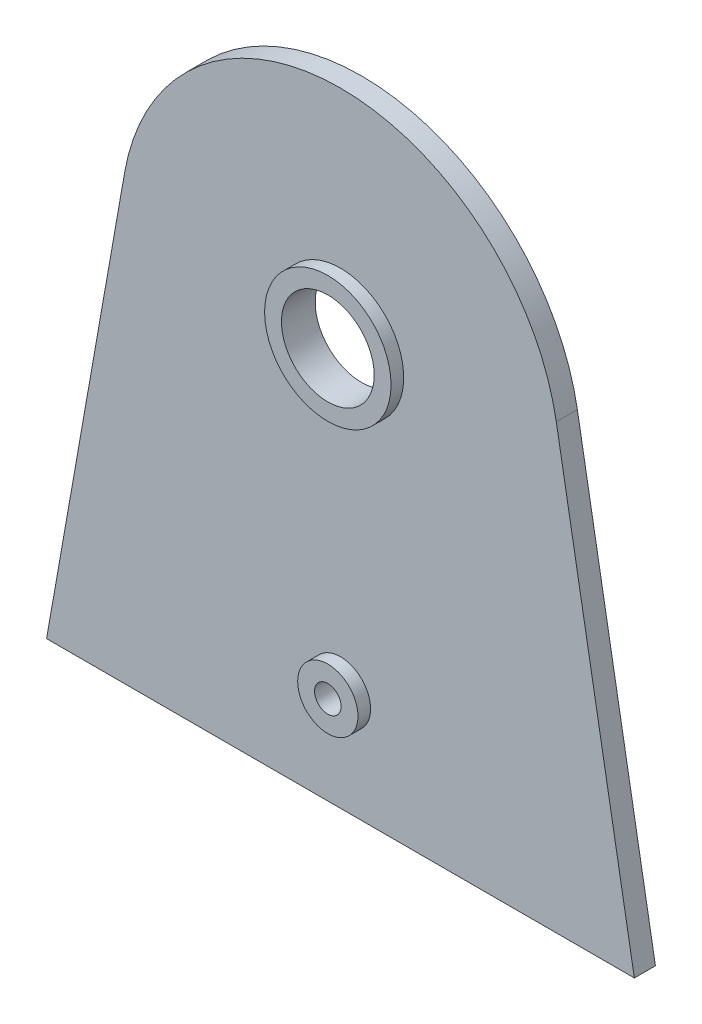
ISO-10303-21;
HEADER;
FILE_DESCRIPTION(('STEP AP214'),'2;1');
FILE_NAME('part.step','',(''),(''),'','','');
FILE_SCHEMA(('AUTOMOTIVE_DESIGN { 1 0 10303 214 1 1 1 1 }'));
ENDSEC;
DATA;
#1=APPLICATION_CONTEXT('core data for automotive mechanical design processes');
#2=APPLICATION_PROTOCOL_DEFINITION('international standard','automotive_design',2000,#1);
#3=PRODUCT_CONTEXT('',#1,'mechanical');
#4=PRODUCT('Part','Part','',(#3));
#5=PRODUCT_RELATED_PRODUCT_CATEGORY('part','',(#4));
#6=PRODUCT_DEFINITION_FORMATION('','',#4);
#7=PRODUCT_DEFINITION_CONTEXT('part definition',#1,'design');
#8=PRODUCT_DEFINITION('design','',#6,#7);
#9=PRODUCT_DEFINITION_SHAPE('','',#8);
#10=(LENGTH_UNIT() NAMED_UNIT(*) SI_UNIT(.MILLI.,.METRE.));
#11=(NAMED_UNIT(*) PLANE_ANGLE_UNIT() SI_UNIT($,.RADIAN.));
#12=(NAMED_UNIT(*) SI_UNIT($,.STERADIAN.) SOLID_ANGLE_UNIT());
#13=UNCERTAINTY_MEASURE_WITH_UNIT(LENGTH_MEASURE(1.E-05),#10,'distance_accuracy_value','');
#14=(GEOMETRIC_REPRESENTATION_CONTEXT(3) GLOBAL_UNCERTAINTY_ASSIGNED_CONTEXT((#13)) GLOBAL_UNIT_ASSIGNED_CONTEXT((#10,
#11,#12)) REPRESENTATION_CONTEXT('',''));
#15=CARTESIAN_POINT('',(0.,0.,0.));
#16=DIRECTION('',(0.,0.,1.));
#17=DIRECTION('',(1.,0.,0.));
#18=AXIS2_PLACEMENT_3D('',#15,#16,#17);
#19=CARTESIAN_POINT('',(0.,72.,0.));
#20=DIRECTION('',(0.,0.,-1.));
#21=DIRECTION('',(-1.,0.,0.));
#22=AXIS2_PLACEMENT_3D('',#19,#20,#21);
#23=PLANE('',#22);
#24=CARTESIAN_POINT('',(0.,72.,0.));
#25=DIRECTION('',(0.,0.,-1.));
#26=DIRECTION('',(-1.,0.,0.));
#27=AXIS2_PLACEMENT_3D('',#24,#25,#26);
#28=CIRCLE('',#27,15.);
#29=CARTESIAN_POINT('',(-15.,72.,0.));
#30=VERTEX_POINT('',#29);
#31=EDGE_CURVE('E46',#30,#30,#28,.F.);
#32=ORIENTED_EDGE('',*,*,#31,.F.);
#33=EDGE_LOOP('',(#32));
#34=FACE_BOUND('',#33,.T.);
#35=CARTESIAN_POINT('',(0.,72.,0.));
#36=DIRECTION('',(0.,0.,1.));
#37=DIRECTION('',(-1.,0.,0.));
#38=AXIS2_PLACEMENT_3D('',#35,#36,#37);
#39=CIRCLE('',#38,52.);
#40=CARTESIAN_POINT('',(51.2100031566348,81.0297052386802,0.));
#41=VERTEX_POINT('',#40);
#42=CARTESIAN_POINT('',(-51.2100031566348,81.0297052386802,0.));
#43=VERTEX_POINT('',#42);
#44=EDGE_CURVE('E106',#41,#43,#39,.T.);
#45=ORIENTED_EDGE('',*,*,#44,.T.);
#46=DIRECTION('',(-0.173648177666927,-0.984807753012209,0.));
#47=VECTOR('',#46,1.);
#48=CARTESIAN_POINT('',(-51.2100031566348,81.0297052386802,0.));
#49=LINE('',#48,#47);
#50=CARTESIAN_POINT('',(-69.7295739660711,-24.,0.));
#51=VERTEX_POINT('',#50);
#52=EDGE_CURVE('E109',#43,#51,#49,.T.);
#53=ORIENTED_EDGE('',*,*,#52,.T.);
#54=DIRECTION('',(1.,0.,0.));
#55=VECTOR('',#54,1.);
#56=CARTESIAN_POINT('',(-69.7295739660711,-24.,0.));
#57=LINE('',#56,#55);
#58=CARTESIAN_POINT('',(69.7295739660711,-24.,0.));
#59=VERTEX_POINT('',#58);
#60=EDGE_CURVE('E90',#51,#59,#57,.T.);
#61=ORIENTED_EDGE('',*,*,#60,.T.);
#62=DIRECTION('',(-0.173648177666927,0.984807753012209,0.));
#63=VECTOR('',#62,1.);
#64=CARTESIAN_POINT('',(69.7295739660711,-24.,0.));
#65=LINE('',#64,#63);
#66=EDGE_CURVE('E101',#59,#41,#65,.T.);
#67=ORIENTED_EDGE('',*,*,#66,.T.);
#68=EDGE_LOOP('',(#45,#53,#61,#67));
#69=FACE_BOUND('',#68,.T.);
#70=CARTESIAN_POINT('',(0.,0.,0.));
#71=DIRECTION('',(0.,0.,-1.));
#72=DIRECTION('',(-1.,0.,0.));
#73=AXIS2_PLACEMENT_3D('',#70,#71,#72);
#74=CIRCLE('',#73,7.15);
#75=CARTESIAN_POINT('',(-7.15,0.,0.));
#76=VERTEX_POINT('',#75);
#77=EDGE_CURVE('E11',#76,#76,#74,.F.);
#78=ORIENTED_EDGE('',*,*,#77,.F.);
#79=EDGE_LOOP('',(#78));
#80=FACE_BOUND('',#79,.T.);
#81=ADVANCED_FACE('F37',(#34,#69,#80),#23,.F.);
#82=CARTESIAN_POINT('',(0.,72.,-5.));
#83=DIRECTION('',(0.,0.,1.));
#84=DIRECTION('',(1.,0.,0.));
#85=AXIS2_PLACEMENT_3D('',#82,#83,#84);
#86=CYLINDRICAL_SURFACE('',#85,52.);
#87=ORIENTED_EDGE('',*,*,#44,.F.);
#88=DIRECTION('',(0.,0.,1.));
#89=VECTOR('',#88,1.);
#90=CARTESIAN_POINT('',(51.2100031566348,81.0297052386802,-5.));
#91=LINE('',#90,#89);
#92=CARTESIAN_POINT('',(51.2100031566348,81.0297052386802,-5.));
#93=VERTEX_POINT('',#92);
#94=EDGE_CURVE('E54',#93,#41,#91,.T.);
#95=ORIENTED_EDGE('',*,*,#94,.F.);
#96=CARTESIAN_POINT('',(0.,72.,-5.));
#97=DIRECTION('',(0.,0.,1.));
#98=DIRECTION('',(-1.,0.,0.));
#99=AXIS2_PLACEMENT_3D('',#96,#97,#98);
#100=CIRCLE('',#99,52.);
#101=CARTESIAN_POINT('',(-51.2100031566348,81.0297052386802,-5.));
#102=VERTEX_POINT('',#101);
#103=EDGE_CURVE('E99',#93,#102,#100,.T.);
#104=ORIENTED_EDGE('',*,*,#103,.T.);
#105=DIRECTION('',(0.,0.,1.));
#106=VECTOR('',#105,1.);
#107=CARTESIAN_POINT('',(-51.2100031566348,81.0297052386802,-5.));
#108=LINE('',#107,#106);
#109=EDGE_CURVE('E82',#102,#43,#108,.T.);
#110=ORIENTED_EDGE('',*,*,#109,.T.);
#111=EDGE_LOOP('',(#87,#95,#104,#110));
#112=FACE_BOUND('',#111,.T.);
#113=ADVANCED_FACE('F39',(#112),#86,.T.);
#114=CARTESIAN_POINT('',(69.7295739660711,-24.,-5.));
#115=DIRECTION('',(0.984807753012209,0.173648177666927,0.));
#116=DIRECTION('',(-0.173648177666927,0.984807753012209,0.));
#117=AXIS2_PLACEMENT_3D('',#114,#115,#116);
#118=PLANE('',#117);
#119=ORIENTED_EDGE('',*,*,#66,.F.);
#120=DIRECTION('',(0.,0.,1.));
#121=VECTOR('',#120,1.);
#122=CARTESIAN_POINT('',(69.7295739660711,-24.,-5.));
#123=LINE('',#122,#121);
#124=CARTESIAN_POINT('',(69.7295739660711,-24.,-5.));
#125=VERTEX_POINT('',#124);
#126=EDGE_CURVE('E71',#125,#59,#123,.T.);
#127=ORIENTED_EDGE('',*,*,#126,.F.);
#128=DIRECTION('',(-0.173648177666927,0.984807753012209,0.));
#129=VECTOR('',#128,1.);
#130=CARTESIAN_POINT('',(69.7295739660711,-24.,-5.));
#131=LINE('',#130,#129);
#132=EDGE_CURVE('E96',#125,#93,#131,.T.);
#133=ORIENTED_EDGE('',*,*,#132,.T.);
#134=ORIENTED_EDGE('',*,*,#94,.T.);
#135=EDGE_LOOP('',(#119,#127,#133,#134));
#136=FACE_BOUND('',#135,.T.);
#137=ADVANCED_FACE('F158',(#136),#118,.T.);
#138=CARTESIAN_POINT('',(-69.7295739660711,-24.,-5.));
#139=DIRECTION('',(0.,-1.,0.));
#140=DIRECTION('',(0.,0.,-1.));
#141=AXIS2_PLACEMENT_3D('',#138,#139,#140);
#142=PLANE('',#141);
#143=ORIENTED_EDGE('',*,*,#60,.F.);
#144=DIRECTION('',(0.,0.,1.));
#145=VECTOR('',#144,1.);
#146=CARTESIAN_POINT('',(-69.7295739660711,-24.,-5.));
#147=LINE('',#146,#145);
#148=CARTESIAN_POINT('',(-69.7295739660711,-24.,-5.));
#149=VERTEX_POINT('',#148);
#150=EDGE_CURVE('E85',#149,#51,#147,.T.);
#151=ORIENTED_EDGE('',*,*,#150,.F.);
#152=DIRECTION('',(1.,0.,0.));
#153=VECTOR('',#152,1.);
#154=CARTESIAN_POINT('',(-69.7295739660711,-24.,-5.));
#155=LINE('',#154,#153);
#156=EDGE_CURVE('E88',#149,#125,#155,.T.);
#157=ORIENTED_EDGE('',*,*,#156,.T.);
#158=ORIENTED_EDGE('',*,*,#126,.T.);
#159=EDGE_LOOP('',(#143,#151,#157,#158));
#160=FACE_BOUND('',#159,.T.);
#161=ADVANCED_FACE('F87',(#160),#142,.T.);
#162=CARTESIAN_POINT('',(-51.2100031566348,81.0297052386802,-5.));
#163=DIRECTION('',(-0.984807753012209,0.173648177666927,0.));
#164=DIRECTION('',(-0.173648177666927,-0.984807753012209,0.));
#165=AXIS2_PLACEMENT_3D('',#162,#163,#164);
#166=PLANE('',#165);
#167=ORIENTED_EDGE('',*,*,#52,.F.);
#168=ORIENTED_EDGE('',*,*,#109,.F.);
#169=DIRECTION('',(-0.173648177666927,-0.984807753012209,0.));
#170=VECTOR('',#169,1.);
#171=CARTESIAN_POINT('',(-51.2100031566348,81.0297052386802,-5.));
#172=LINE('',#171,#170);
#173=EDGE_CURVE('E95',#102,#149,#172,.T.);
#174=ORIENTED_EDGE('',*,*,#173,.T.);
#175=ORIENTED_EDGE('',*,*,#150,.T.);
#176=EDGE_LOOP('',(#167,#168,#174,#175));
#177=FACE_BOUND('',#176,.T.);
#178=ADVANCED_FACE('F98',(#177),#166,.T.);
#179=CARTESIAN_POINT('',(0.,72.,-5.));
#180=DIRECTION('',(0.,0.,-1.));
#181=DIRECTION('',(-1.,0.,0.));
#182=AXIS2_PLACEMENT_3D('',#179,#180,#181);
#183=PLANE('',#182);
#184=CARTESIAN_POINT('',(0.,72.,-5.));
#185=DIRECTION('',(0.,0.,1.));
#186=DIRECTION('',(1.,0.,0.));
#187=AXIS2_PLACEMENT_3D('',#184,#185,#186);
#188=CIRCLE('',#187,11.);
#189=CARTESIAN_POINT('',(11.,72.,-5.));
#190=VERTEX_POINT('',#189);
#191=EDGE_CURVE('E267',#190,#190,#188,.T.);
#192=ORIENTED_EDGE('',*,*,#191,.T.);
#193=EDGE_LOOP('',(#192));
#194=FACE_BOUND('',#193,.T.);
#195=CARTESIAN_POINT('',(0.,0.,-5.));
#196=DIRECTION('',(0.,0.,1.));
#197=DIRECTION('',(1.,0.,0.));
#198=AXIS2_PLACEMENT_3D('',#195,#196,#197);
#199=CIRCLE('',#198,3.15);
#200=CARTESIAN_POINT('',(3.15,0.,-5.));
#201=VERTEX_POINT('',#200);
#202=EDGE_CURVE('E110',#201,#201,#199,.T.);
#203=ORIENTED_EDGE('',*,*,#202,.T.);
#204=EDGE_LOOP('',(#203));
#205=FACE_BOUND('',#204,.T.);
#206=ORIENTED_EDGE('',*,*,#103,.F.);
#207=ORIENTED_EDGE('',*,*,#132,.F.);
#208=ORIENTED_EDGE('',*,*,#156,.F.);
#209=ORIENTED_EDGE('',*,*,#173,.F.);
#210=EDGE_LOOP('',(#206,#207,#208,#209));
#211=FACE_BOUND('',#210,.T.);
#212=ADVANCED_FACE('F94',(#194,#205,#211),#183,.T.);
#213=CARTESIAN_POINT('',(0.,0.,-5.));
#214=DIRECTION('',(0.,0.,1.));
#215=DIRECTION('',(1.,0.,0.));
#216=AXIS2_PLACEMENT_3D('',#213,#214,#215);
#217=CYLINDRICAL_SURFACE('',#216,3.15);
#218=ORIENTED_EDGE('',*,*,#202,.F.);
#219=EDGE_LOOP('',(#218));
#220=FACE_BOUND('',#219,.T.);
#221=CARTESIAN_POINT('',(0.,0.,3.));
#222=DIRECTION('',(0.,0.,1.));
#223=DIRECTION('',(1.,0.,0.));
#224=AXIS2_PLACEMENT_3D('',#221,#222,#223);
#225=CIRCLE('',#224,3.15);
#226=CARTESIAN_POINT('',(3.15,0.,3.));
#227=VERTEX_POINT('',#226);
#228=EDGE_CURVE('E278',#227,#227,#225,.T.);
#229=ORIENTED_EDGE('',*,*,#228,.T.);
#230=EDGE_LOOP('',(#229));
#231=FACE_BOUND('',#230,.T.);
#232=ADVANCED_FACE('F150',(#220,#231),#217,.F.);
#233=CARTESIAN_POINT('',(0.,72.,-5.));
#234=DIRECTION('',(0.,0.,1.));
#235=DIRECTION('',(1.,0.,0.));
#236=AXIS2_PLACEMENT_3D('',#233,#234,#235);
#237=CYLINDRICAL_SURFACE('',#236,11.);
#238=ORIENTED_EDGE('',*,*,#191,.F.);
#239=EDGE_LOOP('',(#238));
#240=FACE_BOUND('',#239,.T.);
#241=CARTESIAN_POINT('',(0.,72.,3.));
#242=DIRECTION('',(0.,0.,1.));
#243=DIRECTION('',(1.,0.,0.));
#244=AXIS2_PLACEMENT_3D('',#241,#242,#243);
#245=CIRCLE('',#244,11.);
#246=CARTESIAN_POINT('',(11.,72.,3.));
#247=VERTEX_POINT('',#246);
#248=EDGE_CURVE('E275',#247,#247,#245,.T.);
#249=ORIENTED_EDGE('',*,*,#248,.T.);
#250=EDGE_LOOP('',(#249));
#251=FACE_BOUND('',#250,.T.);
#252=ADVANCED_FACE('F143',(#240,#251),#237,.F.);
#253=CARTESIAN_POINT('',(0.,72.,3.));
#254=DIRECTION('',(0.,0.,1.));
#255=DIRECTION('',(1.,0.,0.));
#256=AXIS2_PLACEMENT_3D('',#253,#254,#255);
#257=PLANE('',#256);
#258=CARTESIAN_POINT('',(0.,72.,3.));
#259=DIRECTION('',(0.,0.,1.));
#260=DIRECTION('',(1.,0.,0.));
#261=AXIS2_PLACEMENT_3D('',#258,#259,#260);
#262=CIRCLE('',#261,15.);
#263=CARTESIAN_POINT('',(15.,72.,3.));
#264=VERTEX_POINT('',#263);
#265=EDGE_CURVE('E270',#264,#264,#262,.T.);
#266=ORIENTED_EDGE('',*,*,#265,.T.);
#267=EDGE_LOOP('',(#266));
#268=FACE_BOUND('',#267,.T.);
#269=ORIENTED_EDGE('',*,*,#248,.F.);
#270=EDGE_LOOP('',(#269));
#271=FACE_BOUND('',#270,.T.);
#272=ADVANCED_FACE('F140',(#268,#271),#257,.T.);
#273=CARTESIAN_POINT('',(0.,72.,3.));
#274=DIRECTION('',(0.,0.,-1.));
#275=DIRECTION('',(-1.,0.,0.));
#276=AXIS2_PLACEMENT_3D('',#273,#274,#275);
#277=CYLINDRICAL_SURFACE('',#276,15.);
#278=ORIENTED_EDGE('',*,*,#265,.F.);
#279=EDGE_LOOP('',(#278));
#280=FACE_BOUND('',#279,.T.);
#281=ORIENTED_EDGE('',*,*,#31,.T.);
#282=EDGE_LOOP('',(#281));
#283=FACE_BOUND('',#282,.T.);
#284=ADVANCED_FACE('F120',(#280,#283),#277,.T.);
#285=CARTESIAN_POINT('',(0.,0.,3.));
#286=DIRECTION('',(0.,0.,1.));
#287=DIRECTION('',(1.,0.,0.));
#288=AXIS2_PLACEMENT_3D('',#285,#286,#287);
#289=PLANE('',#288);
#290=CARTESIAN_POINT('',(0.,0.,3.));
#291=DIRECTION('',(0.,0.,1.));
#292=DIRECTION('',(1.,0.,0.));
#293=AXIS2_PLACEMENT_3D('',#290,#291,#292);
#294=CIRCLE('',#293,7.15);
#295=CARTESIAN_POINT('',(7.15,0.,3.));
#296=VERTEX_POINT('',#295);
#297=EDGE_CURVE('E281',#296,#296,#294,.T.);
#298=ORIENTED_EDGE('',*,*,#297,.T.);
#299=EDGE_LOOP('',(#298));
#300=FACE_BOUND('',#299,.T.);
#301=ORIENTED_EDGE('',*,*,#228,.F.);
#302=EDGE_LOOP('',(#301));
#303=FACE_BOUND('',#302,.T.);
#304=ADVANCED_FACE('F130',(#300,#303),#289,.T.);
#305=CARTESIAN_POINT('',(0.,0.,3.));
#306=DIRECTION('',(0.,0.,-1.));
#307=DIRECTION('',(-1.,0.,0.));
#308=AXIS2_PLACEMENT_3D('',#305,#306,#307);
#309=CYLINDRICAL_SURFACE('',#308,7.15);
#310=ORIENTED_EDGE('',*,*,#297,.F.);
#311=EDGE_LOOP('',(#310));
#312=FACE_BOUND('',#311,.T.);
#313=ORIENTED_EDGE('',*,*,#77,.T.);
#314=EDGE_LOOP('',(#313));
#315=FACE_BOUND('',#314,.T.);
#316=ADVANCED_FACE('F128',(#312,#315),#309,.T.);
#317=CLOSED_SHELL('',(#81,#113,#137,#161,#178,#212,#232,#252,#272,#284,#304,#316));
#318=MANIFOLD_SOLID_BREP('B2',#317);
#319=ADVANCED_BREP_SHAPE_REPRESENTATION('',(#18,#318),#14);
#320=SHAPE_DEFINITION_REPRESENTATION(#9,#319);
ENDSEC;
END-ISO-10303-21;
